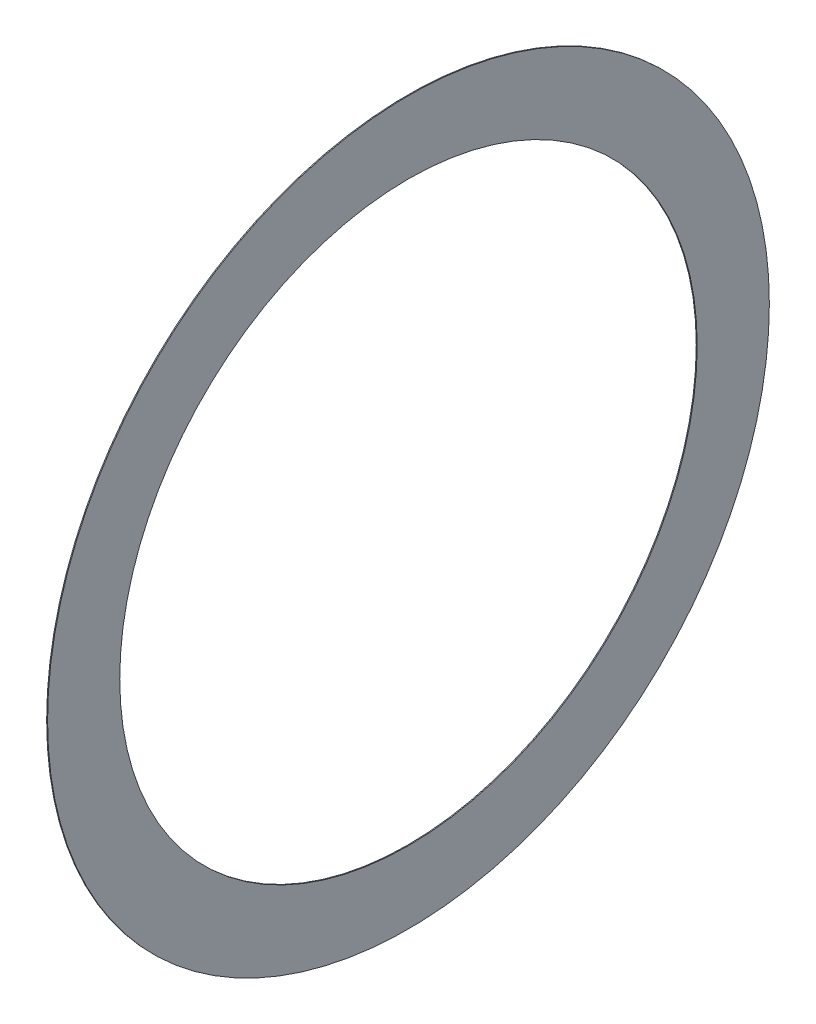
ISO-10303-21;
HEADER;
FILE_DESCRIPTION(('STEP AP214'),'2;1');
FILE_NAME('part.step','',(''),(''),'','','');
FILE_SCHEMA(('AUTOMOTIVE_DESIGN { 1 0 10303 214 1 1 1 1 }'));
ENDSEC;
DATA;
#1=APPLICATION_CONTEXT('core data for automotive mechanical design processes');
#2=APPLICATION_PROTOCOL_DEFINITION('international standard','automotive_design',2000,#1);
#3=PRODUCT_CONTEXT('',#1,'mechanical');
#4=PRODUCT('Part','Part','',(#3));
#5=PRODUCT_RELATED_PRODUCT_CATEGORY('part','',(#4));
#6=PRODUCT_DEFINITION_FORMATION('','',#4);
#7=PRODUCT_DEFINITION_CONTEXT('part definition',#1,'design');
#8=PRODUCT_DEFINITION('design','',#6,#7);
#9=PRODUCT_DEFINITION_SHAPE('','',#8);
#10=(LENGTH_UNIT() NAMED_UNIT(*) SI_UNIT(.MILLI.,.METRE.));
#11=(NAMED_UNIT(*) PLANE_ANGLE_UNIT() SI_UNIT($,.RADIAN.));
#12=(NAMED_UNIT(*) SI_UNIT($,.STERADIAN.) SOLID_ANGLE_UNIT());
#13=UNCERTAINTY_MEASURE_WITH_UNIT(LENGTH_MEASURE(1.E-05),#10,'distance_accuracy_value','');
#14=(GEOMETRIC_REPRESENTATION_CONTEXT(3) GLOBAL_UNCERTAINTY_ASSIGNED_CONTEXT((#13)) GLOBAL_UNIT_ASSIGNED_CONTEXT((#10,
#11,#12)) REPRESENTATION_CONTEXT('',''));
#15=CARTESIAN_POINT('',(0.,0.,0.));
#16=DIRECTION('',(0.,0.,1.));
#17=DIRECTION('',(1.,0.,0.));
#18=AXIS2_PLACEMENT_3D('',#15,#16,#17);
#19=CARTESIAN_POINT('',(0.,97.5,0.));
#20=DIRECTION('',(1.,0.,0.));
#21=DIRECTION('',(0.,0.,-1.));
#22=AXIS2_PLACEMENT_3D('',#19,#20,#21);
#23=PLANE('',#22);
#24=CARTESIAN_POINT('',(0.,0.,0.));
#25=DIRECTION('',(-1.,0.,0.));
#26=DIRECTION('',(0.,0.,1.));
#27=AXIS2_PLACEMENT_3D('',#24,#25,#26);
#28=CIRCLE('',#27,78.);
#29=CARTESIAN_POINT('',(0.,0.,78.));
#30=VERTEX_POINT('',#29);
#31=EDGE_CURVE('E10',#30,#30,#28,.T.);
#32=ORIENTED_EDGE('',*,*,#31,.F.);
#33=EDGE_LOOP('',(#32));
#34=FACE_BOUND('',#33,.T.);
#35=CARTESIAN_POINT('',(0.,0.,0.));
#36=DIRECTION('',(-1.,0.,0.));
#37=DIRECTION('',(0.,0.,1.));
#38=AXIS2_PLACEMENT_3D('',#35,#36,#37);
#39=CIRCLE('',#38,97.5);
#40=CARTESIAN_POINT('',(0.,0.,97.5));
#41=VERTEX_POINT('',#40);
#42=EDGE_CURVE('E42',#41,#41,#39,.T.);
#43=ORIENTED_EDGE('',*,*,#42,.T.);
#44=EDGE_LOOP('',(#43));
#45=FACE_BOUND('',#44,.T.);
#46=ADVANCED_FACE('F28',(#34,#45),#23,.F.);
#47=CARTESIAN_POINT('',(0.,0.,0.));
#48=DIRECTION('',(-1.,0.,0.));
#49=DIRECTION('',(0.,0.,1.));
#50=AXIS2_PLACEMENT_3D('',#47,#48,#49);
#51=CYLINDRICAL_SURFACE('',#50,78.);
#52=CARTESIAN_POINT('',(0.250000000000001,0.,0.));
#53=DIRECTION('',(-1.,0.,0.));
#54=DIRECTION('',(0.,0.,1.));
#55=AXIS2_PLACEMENT_3D('',#52,#53,#54);
#56=CIRCLE('',#55,78.);
#57=CARTESIAN_POINT('',(0.250000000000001,0.,78.));
#58=VERTEX_POINT('',#57);
#59=EDGE_CURVE('E34',#58,#58,#56,.T.);
#60=ORIENTED_EDGE('',*,*,#59,.F.);
#61=EDGE_LOOP('',(#60));
#62=FACE_BOUND('',#61,.T.);
#63=ORIENTED_EDGE('',*,*,#31,.T.);
#64=EDGE_LOOP('',(#63));
#65=FACE_BOUND('',#64,.T.);
#66=ADVANCED_FACE('F57',(#62,#65),#51,.F.);
#67=CARTESIAN_POINT('',(0.25,97.5,0.));
#68=DIRECTION('',(-1.,0.,0.));
#69=DIRECTION('',(0.,0.,1.));
#70=AXIS2_PLACEMENT_3D('',#67,#68,#69);
#71=PLANE('',#70);
#72=CARTESIAN_POINT('',(0.249999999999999,0.,0.));
#73=DIRECTION('',(-1.,0.,0.));
#74=DIRECTION('',(0.,0.,1.));
#75=AXIS2_PLACEMENT_3D('',#72,#73,#74);
#76=CIRCLE('',#75,97.5);
#77=CARTESIAN_POINT('',(0.249999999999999,0.,97.5));
#78=VERTEX_POINT('',#77);
#79=EDGE_CURVE('E38',#78,#78,#76,.T.);
#80=ORIENTED_EDGE('',*,*,#79,.F.);
#81=EDGE_LOOP('',(#80));
#82=FACE_BOUND('',#81,.T.);
#83=ORIENTED_EDGE('',*,*,#59,.T.);
#84=EDGE_LOOP('',(#83));
#85=FACE_BOUND('',#84,.T.);
#86=ADVANCED_FACE('F52',(#82,#85),#71,.F.);
#87=CARTESIAN_POINT('',(0.,0.,0.));
#88=DIRECTION('',(-1.,0.,0.));
#89=DIRECTION('',(0.,0.,1.));
#90=AXIS2_PLACEMENT_3D('',#87,#88,#89);
#91=CYLINDRICAL_SURFACE('',#90,97.5);
#92=ORIENTED_EDGE('',*,*,#42,.F.);
#93=EDGE_LOOP('',(#92));
#94=FACE_BOUND('',#93,.T.);
#95=ORIENTED_EDGE('',*,*,#79,.T.);
#96=EDGE_LOOP('',(#95));
#97=FACE_BOUND('',#96,.T.);
#98=ADVANCED_FACE('F49',(#94,#97),#91,.T.);
#99=CLOSED_SHELL('',(#46,#66,#86,#98));
#100=MANIFOLD_SOLID_BREP('B2',#99);
#101=ADVANCED_BREP_SHAPE_REPRESENTATION('',(#18,#100),#14);
#102=SHAPE_DEFINITION_REPRESENTATION(#9,#101);
ENDSEC;
END-ISO-10303-21;
